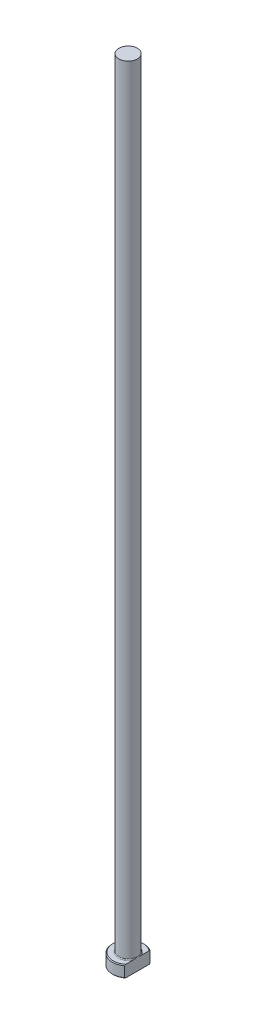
from build123d import *
from build123d.topology import SkipClean

# Parameters (mm, degrees)
CHAMFER1_SIZE = 0.2
FILLET1_R     = 0.2
KEY_DEPTH     = 201.079984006


with BuildPart() as part:
    # Sketch1 → Revolve1 (revolve)
    with BuildSketch(Plane.XY, mode=Mode.PRIVATE) as revolve1_sk:
        Polygon((0, 0), (-4, 0), (-4, 3), (-2.35, 3), (-2.35, 200), (0, 200), align=None)
    revolve(revolve1_sk.sketch.rotate(Axis((0, 259.958771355, 0), (0, -1, 0)), 270), axis=Axis((0, 259.958771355, 0), (0, -1, 0)))

    # Chamfer1
    chamfer1_edges = [part.edges().sort_by_distance(p)[0] for p in [
        (0, 3, -4),
        (0, 0, -4),
    ]]
    chamfer(chamfer1_edges, length=CHAMFER1_SIZE)

    # Fillet1
    fillet1_edges = [part.edges().sort_by_distance(p)[0] for p in [
        (0, 3, -2.35),
    ]]
    fillet(fillet1_edges, radius=FILLET1_R)

    # Sketch2 → KEY (cut, through all)
    with SkipClean():  # the faces are left unmerged after this step: merging them gives an invalid solid
        with BuildSketch(Plane(origin=(0, 0, 0), x_dir=(1, 0, 0), z_dir=(0, 1, 0))):
            with BuildLine():
                Line((2.35, 3.236896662), (2.35, -3.236896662))
                ThreePointArc((2.35, -3.236896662), (4, 0), (2.35, 3.236896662))
            make_face()
        extrude(amount=KEY_DEPTH, mode=Mode.SUBTRACT)


solid = part.part
